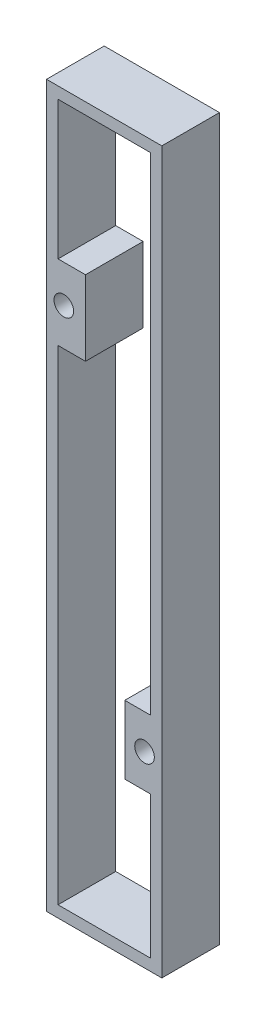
ISO-10303-21;
HEADER;
FILE_DESCRIPTION(('STEP AP214'),'2;1');
FILE_NAME('part.step','',(''),(''),'','','');
FILE_SCHEMA(('AUTOMOTIVE_DESIGN { 1 0 10303 214 1 1 1 1 }'));
ENDSEC;
DATA;
#1=APPLICATION_CONTEXT('core data for automotive mechanical design processes');
#2=APPLICATION_PROTOCOL_DEFINITION('international standard','automotive_design',2000,#1);
#3=PRODUCT_CONTEXT('',#1,'mechanical');
#4=PRODUCT('Part','Part','',(#3));
#5=PRODUCT_RELATED_PRODUCT_CATEGORY('part','',(#4));
#6=PRODUCT_DEFINITION_FORMATION('','',#4);
#7=PRODUCT_DEFINITION_CONTEXT('part definition',#1,'design');
#8=PRODUCT_DEFINITION('design','',#6,#7);
#9=PRODUCT_DEFINITION_SHAPE('','',#8);
#10=(LENGTH_UNIT() NAMED_UNIT(*) SI_UNIT(.MILLI.,.METRE.));
#11=(NAMED_UNIT(*) PLANE_ANGLE_UNIT() SI_UNIT($,.RADIAN.));
#12=(NAMED_UNIT(*) SI_UNIT($,.STERADIAN.) SOLID_ANGLE_UNIT());
#13=UNCERTAINTY_MEASURE_WITH_UNIT(LENGTH_MEASURE(1.E-05),#10,'distance_accuracy_value','');
#14=(GEOMETRIC_REPRESENTATION_CONTEXT(3) GLOBAL_UNCERTAINTY_ASSIGNED_CONTEXT((#13)) GLOBAL_UNIT_ASSIGNED_CONTEXT((#10,
#11,#12)) REPRESENTATION_CONTEXT('',''));
#15=CARTESIAN_POINT('',(0.,0.,0.));
#16=DIRECTION('',(0.,0.,1.));
#17=DIRECTION('',(1.,0.,0.));
#18=AXIS2_PLACEMENT_3D('',#15,#16,#17);
#19=CARTESIAN_POINT('',(22.86,2.54,0.));
#20=DIRECTION('',(1.,0.,0.));
#21=DIRECTION('',(0.,0.,-1.));
#22=AXIS2_PLACEMENT_3D('',#19,#20,#21);
#23=PLANE('',#22);
#24=DIRECTION('',(0.,0.,-1.));
#25=VECTOR('',#24,1.);
#26=CARTESIAN_POINT('',(22.86,2.54,0.));
#27=LINE('',#26,#25);
#28=CARTESIAN_POINT('',(22.86,2.54,0.));
#29=VERTEX_POINT('',#28);
#30=CARTESIAN_POINT('',(22.86,2.54,12.7));
#31=VERTEX_POINT('',#30);
#32=EDGE_CURVE('E127',#29,#31,#27,.F.);
#33=ORIENTED_EDGE('',*,*,#32,.T.);
#34=DIRECTION('',(0.,1.,0.));
#35=VECTOR('',#34,1.);
#36=CARTESIAN_POINT('',(22.86,79.375,12.7));
#37=LINE('',#36,#35);
#38=CARTESIAN_POINT('',(22.86,33.8558442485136,12.7));
#39=VERTEX_POINT('',#38);
#40=EDGE_CURVE('E265',#39,#31,#37,.F.);
#41=ORIENTED_EDGE('',*,*,#40,.F.);
#42=DIRECTION('',(0.,0.,1.));
#43=VECTOR('',#42,1.);
#44=CARTESIAN_POINT('',(22.86,33.8558442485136,0.));
#45=LINE('',#44,#43);
#46=CARTESIAN_POINT('',(22.86,33.8558442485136,0.));
#47=VERTEX_POINT('',#46);
#48=EDGE_CURVE('E161',#39,#47,#45,.F.);
#49=ORIENTED_EDGE('',*,*,#48,.T.);
#50=DIRECTION('',(0.,1.,0.));
#51=VECTOR('',#50,1.);
#52=CARTESIAN_POINT('',(22.86,79.375,0.));
#53=LINE('',#52,#51);
#54=EDGE_CURVE('E197',#47,#29,#53,.F.);
#55=ORIENTED_EDGE('',*,*,#54,.T.);
#56=EDGE_LOOP('',(#33,#41,#49,#55));
#57=FACE_BOUND('',#56,.T.);
#58=ADVANCED_FACE('F17',(#57),#23,.F.);
#59=CARTESIAN_POINT('',(2.54,2.54,0.));
#60=DIRECTION('',(0.,-1.,0.));
#61=DIRECTION('',(0.,0.,-1.));
#62=AXIS2_PLACEMENT_3D('',#59,#60,#61);
#63=PLANE('',#62);
#64=DIRECTION('',(0.,0.,1.));
#65=VECTOR('',#64,1.);
#66=CARTESIAN_POINT('',(2.54,2.54,0.));
#67=LINE('',#66,#65);
#68=CARTESIAN_POINT('',(2.54,2.54,0.));
#69=VERTEX_POINT('',#68);
#70=CARTESIAN_POINT('',(2.54,2.54,12.7));
#71=VERTEX_POINT('',#70);
#72=EDGE_CURVE('E133',#69,#71,#67,.T.);
#73=ORIENTED_EDGE('',*,*,#72,.T.);
#74=DIRECTION('',(1.,0.,0.));
#75=VECTOR('',#74,1.);
#76=CARTESIAN_POINT('',(12.7,2.54,12.7));
#77=LINE('',#76,#75);
#78=EDGE_CURVE('E263',#31,#71,#77,.F.);
#79=ORIENTED_EDGE('',*,*,#78,.F.);
#80=ORIENTED_EDGE('',*,*,#32,.F.);
#81=DIRECTION('',(1.,0.,0.));
#82=VECTOR('',#81,1.);
#83=CARTESIAN_POINT('',(12.7,2.54,0.));
#84=LINE('',#83,#82);
#85=EDGE_CURVE('E130',#29,#69,#84,.F.);
#86=ORIENTED_EDGE('',*,*,#85,.T.);
#87=EDGE_LOOP('',(#73,#79,#80,#86));
#88=FACE_BOUND('',#87,.T.);
#89=ADVANCED_FACE('F132',(#88),#63,.F.);
#90=CARTESIAN_POINT('',(2.54,109.23915652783,0.));
#91=DIRECTION('',(-1.,0.,0.));
#92=DIRECTION('',(0.,0.,1.));
#93=AXIS2_PLACEMENT_3D('',#90,#91,#92);
#94=PLANE('',#93);
#95=DIRECTION('',(0.,0.,1.));
#96=VECTOR('',#95,1.);
#97=CARTESIAN_POINT('',(2.54,109.23915652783,0.));
#98=LINE('',#97,#96);
#99=CARTESIAN_POINT('',(2.54,109.23915652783,0.));
#100=VERTEX_POINT('',#99);
#101=CARTESIAN_POINT('',(2.54,109.23915652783,12.7));
#102=VERTEX_POINT('',#101);
#103=EDGE_CURVE('E147',#100,#102,#98,.T.);
#104=ORIENTED_EDGE('',*,*,#103,.T.);
#105=DIRECTION('',(0.,1.,0.));
#106=VECTOR('',#105,1.);
#107=CARTESIAN_POINT('',(2.54,79.375,12.7));
#108=LINE('',#107,#106);
#109=EDGE_CURVE('E145',#71,#102,#108,.T.);
#110=ORIENTED_EDGE('',*,*,#109,.F.);
#111=ORIENTED_EDGE('',*,*,#72,.F.);
#112=DIRECTION('',(0.,1.,0.));
#113=VECTOR('',#112,1.);
#114=CARTESIAN_POINT('',(2.54,79.375,0.));
#115=LINE('',#114,#113);
#116=EDGE_CURVE('E138',#69,#100,#115,.T.);
#117=ORIENTED_EDGE('',*,*,#116,.T.);
#118=EDGE_LOOP('',(#104,#110,#111,#117));
#119=FACE_BOUND('',#118,.T.);
#120=ADVANCED_FACE('F142',(#119),#94,.F.);
#121=CARTESIAN_POINT('',(8.57944774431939,109.23915652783,0.));
#122=DIRECTION('',(0.,1.,0.));
#123=DIRECTION('',(0.,0.,1.));
#124=AXIS2_PLACEMENT_3D('',#121,#122,#123);
#125=PLANE('',#124);
#126=DIRECTION('',(0.,0.,1.));
#127=VECTOR('',#126,1.);
#128=CARTESIAN_POINT('',(8.57944774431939,109.23915652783,0.));
#129=LINE('',#128,#127);
#130=CARTESIAN_POINT('',(8.57944774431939,109.23915652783,0.));
#131=VERTEX_POINT('',#130);
#132=CARTESIAN_POINT('',(8.57944774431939,109.23915652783,12.7));
#133=VERTEX_POINT('',#132);
#134=EDGE_CURVE('E177',#131,#133,#129,.T.);
#135=ORIENTED_EDGE('',*,*,#134,.T.);
#136=DIRECTION('',(1.,0.,0.));
#137=VECTOR('',#136,1.);
#138=CARTESIAN_POINT('',(12.7,109.23915652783,12.7));
#139=LINE('',#138,#137);
#140=EDGE_CURVE('E259',#102,#133,#139,.T.);
#141=ORIENTED_EDGE('',*,*,#140,.F.);
#142=ORIENTED_EDGE('',*,*,#103,.F.);
#143=DIRECTION('',(1.,0.,0.));
#144=VECTOR('',#143,1.);
#145=CARTESIAN_POINT('',(12.7,109.23915652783,0.));
#146=LINE('',#145,#144);
#147=EDGE_CURVE('E154',#100,#131,#146,.T.);
#148=ORIENTED_EDGE('',*,*,#147,.T.);
#149=EDGE_LOOP('',(#135,#141,#142,#148));
#150=FACE_BOUND('',#149,.T.);
#151=ADVANCED_FACE('F322',(#150),#125,.F.);
#152=CARTESIAN_POINT('',(8.57944774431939,125.755380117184,0.));
#153=DIRECTION('',(-1.,0.,0.));
#154=DIRECTION('',(0.,0.,1.));
#155=AXIS2_PLACEMENT_3D('',#152,#153,#154);
#156=PLANE('',#155);
#157=DIRECTION('',(0.,0.,-1.));
#158=VECTOR('',#157,1.);
#159=CARTESIAN_POINT('',(8.57944774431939,125.755380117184,0.));
#160=LINE('',#159,#158);
#161=CARTESIAN_POINT('',(8.57944774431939,125.755380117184,0.));
#162=VERTEX_POINT('',#161);
#163=CARTESIAN_POINT('',(8.57944774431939,125.755380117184,12.7));
#164=VERTEX_POINT('',#163);
#165=EDGE_CURVE('E175',#162,#164,#160,.F.);
#166=ORIENTED_EDGE('',*,*,#165,.T.);
#167=DIRECTION('',(0.,1.,0.));
#168=VECTOR('',#167,1.);
#169=CARTESIAN_POINT('',(8.57944774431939,79.375,12.7));
#170=LINE('',#169,#168);
#171=EDGE_CURVE('E254',#133,#164,#170,.T.);
#172=ORIENTED_EDGE('',*,*,#171,.F.);
#173=ORIENTED_EDGE('',*,*,#134,.F.);
#174=DIRECTION('',(0.,1.,0.));
#175=VECTOR('',#174,1.);
#176=CARTESIAN_POINT('',(8.57944774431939,79.375,0.));
#177=LINE('',#176,#175);
#178=EDGE_CURVE('E156',#131,#162,#177,.T.);
#179=ORIENTED_EDGE('',*,*,#178,.T.);
#180=EDGE_LOOP('',(#166,#172,#173,#179));
#181=FACE_BOUND('',#180,.T.);
#182=ADVANCED_FACE('F221',(#181),#156,.F.);
#183=CARTESIAN_POINT('',(2.54,125.755380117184,0.));
#184=DIRECTION('',(0.,-1.,0.));
#185=DIRECTION('',(0.,0.,-1.));
#186=AXIS2_PLACEMENT_3D('',#183,#184,#185);
#187=PLANE('',#186);
#188=DIRECTION('',(0.,0.,1.));
#189=VECTOR('',#188,1.);
#190=CARTESIAN_POINT('',(2.54,125.755380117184,0.));
#191=LINE('',#190,#189);
#192=CARTESIAN_POINT('',(2.54,125.755380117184,0.));
#193=VERTEX_POINT('',#192);
#194=CARTESIAN_POINT('',(2.54,125.755380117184,12.7));
#195=VERTEX_POINT('',#194);
#196=EDGE_CURVE('E173',#193,#195,#191,.T.);
#197=ORIENTED_EDGE('',*,*,#196,.T.);
#198=DIRECTION('',(1.,0.,0.));
#199=VECTOR('',#198,1.);
#200=CARTESIAN_POINT('',(12.7,125.755380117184,12.7));
#201=LINE('',#200,#199);
#202=EDGE_CURVE('E229',#164,#195,#201,.F.);
#203=ORIENTED_EDGE('',*,*,#202,.F.);
#204=ORIENTED_EDGE('',*,*,#165,.F.);
#205=DIRECTION('',(1.,0.,0.));
#206=VECTOR('',#205,1.);
#207=CARTESIAN_POINT('',(12.7,125.755380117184,0.));
#208=LINE('',#207,#206);
#209=EDGE_CURVE('E217',#162,#193,#208,.F.);
#210=ORIENTED_EDGE('',*,*,#209,.T.);
#211=EDGE_LOOP('',(#197,#203,#204,#210));
#212=FACE_BOUND('',#211,.T.);
#213=ADVANCED_FACE('F226',(#212),#187,.F.);
#214=CARTESIAN_POINT('',(2.54,156.21,0.));
#215=DIRECTION('',(-1.,0.,0.));
#216=DIRECTION('',(0.,0.,1.));
#217=AXIS2_PLACEMENT_3D('',#214,#215,#216);
#218=PLANE('',#217);
#219=DIRECTION('',(0.,0.,1.));
#220=VECTOR('',#219,1.);
#221=CARTESIAN_POINT('',(2.54,156.21,0.));
#222=LINE('',#221,#220);
#223=CARTESIAN_POINT('',(2.54,156.21,0.));
#224=VERTEX_POINT('',#223);
#225=CARTESIAN_POINT('',(2.54,156.21,12.7));
#226=VERTEX_POINT('',#225);
#227=EDGE_CURVE('E171',#224,#226,#222,.T.);
#228=ORIENTED_EDGE('',*,*,#227,.T.);
#229=DIRECTION('',(0.,1.,0.));
#230=VECTOR('',#229,1.);
#231=CARTESIAN_POINT('',(2.54,79.375,12.7));
#232=LINE('',#231,#230);
#233=EDGE_CURVE('E249',#195,#226,#232,.T.);
#234=ORIENTED_EDGE('',*,*,#233,.F.);
#235=ORIENTED_EDGE('',*,*,#196,.F.);
#236=DIRECTION('',(0.,1.,0.));
#237=VECTOR('',#236,1.);
#238=CARTESIAN_POINT('',(2.54,79.375,0.));
#239=LINE('',#238,#237);
#240=EDGE_CURVE('E215',#193,#224,#239,.T.);
#241=ORIENTED_EDGE('',*,*,#240,.T.);
#242=EDGE_LOOP('',(#228,#234,#235,#241));
#243=FACE_BOUND('',#242,.T.);
#244=ADVANCED_FACE('F236',(#243),#218,.F.);
#245=CARTESIAN_POINT('',(22.86,156.21,0.));
#246=DIRECTION('',(0.,1.,0.));
#247=DIRECTION('',(0.,0.,1.));
#248=AXIS2_PLACEMENT_3D('',#245,#246,#247);
#249=PLANE('',#248);
#250=DIRECTION('',(0.,0.,-1.));
#251=VECTOR('',#250,1.);
#252=CARTESIAN_POINT('',(22.86,156.21,0.));
#253=LINE('',#252,#251);
#254=CARTESIAN_POINT('',(22.86,156.21,0.));
#255=VERTEX_POINT('',#254);
#256=CARTESIAN_POINT('',(22.86,156.21,12.7));
#257=VERTEX_POINT('',#256);
#258=EDGE_CURVE('E169',#255,#257,#253,.F.);
#259=ORIENTED_EDGE('',*,*,#258,.T.);
#260=DIRECTION('',(1.,0.,0.));
#261=VECTOR('',#260,1.);
#262=CARTESIAN_POINT('',(12.7,156.21,12.7));
#263=LINE('',#262,#261);
#264=EDGE_CURVE('E243',#226,#257,#263,.T.);
#265=ORIENTED_EDGE('',*,*,#264,.F.);
#266=ORIENTED_EDGE('',*,*,#227,.F.);
#267=DIRECTION('',(1.,0.,0.));
#268=VECTOR('',#267,1.);
#269=CARTESIAN_POINT('',(12.7,156.21,0.));
#270=LINE('',#269,#268);
#271=EDGE_CURVE('E213',#224,#255,#270,.T.);
#272=ORIENTED_EDGE('',*,*,#271,.T.);
#273=EDGE_LOOP('',(#259,#265,#266,#272));
#274=FACE_BOUND('',#273,.T.);
#275=ADVANCED_FACE('F240',(#274),#249,.F.);
#276=CARTESIAN_POINT('',(22.86,48.8946351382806,0.));
#277=DIRECTION('',(1.,0.,0.));
#278=DIRECTION('',(0.,0.,-1.));
#279=AXIS2_PLACEMENT_3D('',#276,#277,#278);
#280=PLANE('',#279);
#281=DIRECTION('',(0.,0.,-1.));
#282=VECTOR('',#281,1.);
#283=CARTESIAN_POINT('',(22.86,48.8946351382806,0.));
#284=LINE('',#283,#282);
#285=CARTESIAN_POINT('',(22.86,48.8946351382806,0.));
#286=VERTEX_POINT('',#285);
#287=CARTESIAN_POINT('',(22.86,48.8946351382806,12.7));
#288=VERTEX_POINT('',#287);
#289=EDGE_CURVE('E167',#286,#288,#284,.F.);
#290=ORIENTED_EDGE('',*,*,#289,.T.);
#291=DIRECTION('',(0.,1.,0.));
#292=VECTOR('',#291,1.);
#293=CARTESIAN_POINT('',(22.86,79.375,12.7));
#294=LINE('',#293,#292);
#295=EDGE_CURVE('E248',#257,#288,#294,.F.);
#296=ORIENTED_EDGE('',*,*,#295,.F.);
#297=ORIENTED_EDGE('',*,*,#258,.F.);
#298=DIRECTION('',(0.,1.,0.));
#299=VECTOR('',#298,1.);
#300=CARTESIAN_POINT('',(22.86,79.375,0.));
#301=LINE('',#300,#299);
#302=EDGE_CURVE('E211',#255,#286,#301,.F.);
#303=ORIENTED_EDGE('',*,*,#302,.T.);
#304=EDGE_LOOP('',(#290,#296,#297,#303));
#305=FACE_BOUND('',#304,.T.);
#306=ADVANCED_FACE('F305',(#305),#280,.F.);
#307=CARTESIAN_POINT('',(17.2372983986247,48.8946351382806,0.));
#308=DIRECTION('',(0.,-1.,0.));
#309=DIRECTION('',(0.,0.,-1.));
#310=AXIS2_PLACEMENT_3D('',#307,#308,#309);
#311=PLANE('',#310);
#312=DIRECTION('',(0.,0.,-1.));
#313=VECTOR('',#312,1.);
#314=CARTESIAN_POINT('',(17.2372983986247,48.8946351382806,0.));
#315=LINE('',#314,#313);
#316=CARTESIAN_POINT('',(17.2372983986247,48.8946351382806,0.));
#317=VERTEX_POINT('',#316);
#318=CARTESIAN_POINT('',(17.2372983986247,48.8946351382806,12.7));
#319=VERTEX_POINT('',#318);
#320=EDGE_CURVE('E165',#317,#319,#315,.F.);
#321=ORIENTED_EDGE('',*,*,#320,.T.);
#322=DIRECTION('',(1.,0.,0.));
#323=VECTOR('',#322,1.);
#324=CARTESIAN_POINT('',(12.7,48.8946351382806,12.7));
#325=LINE('',#324,#323);
#326=EDGE_CURVE('E301',#288,#319,#325,.F.);
#327=ORIENTED_EDGE('',*,*,#326,.F.);
#328=ORIENTED_EDGE('',*,*,#289,.F.);
#329=DIRECTION('',(1.,0.,0.));
#330=VECTOR('',#329,1.);
#331=CARTESIAN_POINT('',(12.7,48.8946351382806,0.));
#332=LINE('',#331,#330);
#333=EDGE_CURVE('E209',#286,#317,#332,.F.);
#334=ORIENTED_EDGE('',*,*,#333,.T.);
#335=EDGE_LOOP('',(#321,#327,#328,#334));
#336=FACE_BOUND('',#335,.T.);
#337=ADVANCED_FACE('F309',(#336),#311,.F.);
#338=CARTESIAN_POINT('',(17.2372983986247,33.8558442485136,0.));
#339=DIRECTION('',(1.,0.,0.));
#340=DIRECTION('',(0.,0.,-1.));
#341=AXIS2_PLACEMENT_3D('',#338,#339,#340);
#342=PLANE('',#341);
#343=DIRECTION('',(0.,0.,1.));
#344=VECTOR('',#343,1.);
#345=CARTESIAN_POINT('',(17.2372983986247,33.8558442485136,0.));
#346=LINE('',#345,#344);
#347=CARTESIAN_POINT('',(17.2372983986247,33.8558442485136,0.));
#348=VERTEX_POINT('',#347);
#349=CARTESIAN_POINT('',(17.2372983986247,33.8558442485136,12.7));
#350=VERTEX_POINT('',#349);
#351=EDGE_CURVE('E163',#348,#350,#346,.T.);
#352=ORIENTED_EDGE('',*,*,#351,.T.);
#353=DIRECTION('',(0.,1.,0.));
#354=VECTOR('',#353,1.);
#355=CARTESIAN_POINT('',(17.2372983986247,79.375,12.7));
#356=LINE('',#355,#354);
#357=EDGE_CURVE('E299',#319,#350,#356,.F.);
#358=ORIENTED_EDGE('',*,*,#357,.F.);
#359=ORIENTED_EDGE('',*,*,#320,.F.);
#360=DIRECTION('',(0.,1.,0.));
#361=VECTOR('',#360,1.);
#362=CARTESIAN_POINT('',(17.2372983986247,79.375,0.));
#363=LINE('',#362,#361);
#364=EDGE_CURVE('E204',#317,#348,#363,.F.);
#365=ORIENTED_EDGE('',*,*,#364,.T.);
#366=EDGE_LOOP('',(#352,#358,#359,#365));
#367=FACE_BOUND('',#366,.T.);
#368=ADVANCED_FACE('F314',(#367),#342,.F.);
#369=CARTESIAN_POINT('',(22.86,33.8558442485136,0.));
#370=DIRECTION('',(0.,1.,0.));
#371=DIRECTION('',(0.,0.,1.));
#372=AXIS2_PLACEMENT_3D('',#369,#370,#371);
#373=PLANE('',#372);
#374=ORIENTED_EDGE('',*,*,#48,.F.);
#375=DIRECTION('',(1.,0.,0.));
#376=VECTOR('',#375,1.);
#377=CARTESIAN_POINT('',(12.7,33.8558442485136,12.7));
#378=LINE('',#377,#376);
#379=EDGE_CURVE('E187',#350,#39,#378,.T.);
#380=ORIENTED_EDGE('',*,*,#379,.F.);
#381=ORIENTED_EDGE('',*,*,#351,.F.);
#382=DIRECTION('',(1.,0.,0.));
#383=VECTOR('',#382,1.);
#384=CARTESIAN_POINT('',(12.7,33.8558442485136,0.));
#385=LINE('',#384,#383);
#386=EDGE_CURVE('E200',#348,#47,#385,.T.);
#387=ORIENTED_EDGE('',*,*,#386,.T.);
#388=EDGE_LOOP('',(#374,#380,#381,#387));
#389=FACE_BOUND('',#388,.T.);
#390=ADVANCED_FACE('F319',(#389),#373,.F.);
#391=CARTESIAN_POINT('',(21.59,41.275,0.));
#392=DIRECTION('',(0.,0.,1.));
#393=DIRECTION('',(1.,0.,0.));
#394=AXIS2_PLACEMENT_3D('',#391,#392,#393);
#395=CYLINDRICAL_SURFACE('',#394,2.159);
#396=CARTESIAN_POINT('',(21.59,41.275,0.));
#397=DIRECTION('',(0.,0.,1.));
#398=DIRECTION('',(1.,0.,0.));
#399=AXIS2_PLACEMENT_3D('',#396,#397,#398);
#400=CIRCLE('',#399,2.159);
#401=CARTESIAN_POINT('',(23.749,41.275,0.));
#402=VERTEX_POINT('',#401);
#403=EDGE_CURVE('E20',#402,#402,#400,.F.);
#404=ORIENTED_EDGE('',*,*,#403,.T.);
#405=EDGE_LOOP('',(#404));
#406=FACE_BOUND('',#405,.T.);
#407=CARTESIAN_POINT('',(21.59,41.275,12.7));
#408=DIRECTION('',(0.,0.,1.));
#409=DIRECTION('',(1.,0.,0.));
#410=AXIS2_PLACEMENT_3D('',#407,#408,#409);
#411=CIRCLE('',#410,2.159);
#412=CARTESIAN_POINT('',(23.749,41.275,12.7));
#413=VERTEX_POINT('',#412);
#414=EDGE_CURVE('E185',#413,#413,#411,.F.);
#415=ORIENTED_EDGE('',*,*,#414,.F.);
#416=EDGE_LOOP('',(#415));
#417=FACE_BOUND('',#416,.T.);
#418=ADVANCED_FACE('F354',(#406,#417),#395,.F.);
#419=CARTESIAN_POINT('',(3.81,117.475,0.));
#420=DIRECTION('',(0.,0.,1.));
#421=DIRECTION('',(1.,0.,0.));
#422=AXIS2_PLACEMENT_3D('',#419,#420,#421);
#423=CYLINDRICAL_SURFACE('',#422,2.159);
#424=CARTESIAN_POINT('',(3.81,117.475,0.));
#425=DIRECTION('',(0.,0.,1.));
#426=DIRECTION('',(1.,0.,0.));
#427=AXIS2_PLACEMENT_3D('',#424,#425,#426);
#428=CIRCLE('',#427,2.159);
#429=CARTESIAN_POINT('',(5.969,117.475,0.));
#430=VERTEX_POINT('',#429);
#431=EDGE_CURVE('E188',#430,#430,#428,.F.);
#432=ORIENTED_EDGE('',*,*,#431,.T.);
#433=EDGE_LOOP('',(#432));
#434=FACE_BOUND('',#433,.T.);
#435=CARTESIAN_POINT('',(3.81,117.475,12.7));
#436=DIRECTION('',(0.,0.,1.));
#437=DIRECTION('',(1.,0.,0.));
#438=AXIS2_PLACEMENT_3D('',#435,#436,#437);
#439=CIRCLE('',#438,2.159);
#440=CARTESIAN_POINT('',(5.969,117.475,12.7));
#441=VERTEX_POINT('',#440);
#442=EDGE_CURVE('E181',#441,#441,#439,.F.);
#443=ORIENTED_EDGE('',*,*,#442,.F.);
#444=EDGE_LOOP('',(#443));
#445=FACE_BOUND('',#444,.T.);
#446=ADVANCED_FACE('F351',(#434,#445),#423,.F.);
#447=CARTESIAN_POINT('',(25.4,0.,0.));
#448=DIRECTION('',(1.,0.,0.));
#449=DIRECTION('',(0.,0.,-1.));
#450=AXIS2_PLACEMENT_3D('',#447,#448,#449);
#451=PLANE('',#450);
#452=DIRECTION('',(0.,1.,0.));
#453=VECTOR('',#452,1.);
#454=CARTESIAN_POINT('',(25.4,79.375,12.7));
#455=LINE('',#454,#453);
#456=CARTESIAN_POINT('',(25.4,0.,12.7));
#457=VERTEX_POINT('',#456);
#458=CARTESIAN_POINT('',(25.4,158.75,12.7));
#459=VERTEX_POINT('',#458);
#460=EDGE_CURVE('E268',#457,#459,#455,.T.);
#461=ORIENTED_EDGE('',*,*,#460,.F.);
#462=DIRECTION('',(0.,0.,-1.));
#463=VECTOR('',#462,1.);
#464=CARTESIAN_POINT('',(25.4,0.,0.));
#465=LINE('',#464,#463);
#466=CARTESIAN_POINT('',(25.4,0.,0.));
#467=VERTEX_POINT('',#466);
#468=EDGE_CURVE('E194',#467,#457,#465,.F.);
#469=ORIENTED_EDGE('',*,*,#468,.F.);
#470=DIRECTION('',(0.,1.,0.));
#471=VECTOR('',#470,1.);
#472=CARTESIAN_POINT('',(25.4,79.375,0.));
#473=LINE('',#472,#471);
#474=CARTESIAN_POINT('',(25.4,158.75,0.));
#475=VERTEX_POINT('',#474);
#476=EDGE_CURVE('E139',#467,#475,#473,.T.);
#477=ORIENTED_EDGE('',*,*,#476,.T.);
#478=DIRECTION('',(0.,0.,1.));
#479=VECTOR('',#478,1.);
#480=CARTESIAN_POINT('',(25.4,158.75,0.));
#481=LINE('',#480,#479);
#482=EDGE_CURVE('E281',#459,#475,#481,.F.);
#483=ORIENTED_EDGE('',*,*,#482,.F.);
#484=EDGE_LOOP('',(#461,#469,#477,#483));
#485=FACE_BOUND('',#484,.T.);
#486=ADVANCED_FACE('F279',(#485),#451,.T.);
#487=CARTESIAN_POINT('',(12.7,79.375,0.));
#488=DIRECTION('',(0.,0.,1.));
#489=DIRECTION('',(1.,0.,0.));
#490=AXIS2_PLACEMENT_3D('',#487,#488,#489);
#491=PLANE('',#490);
#492=ORIENTED_EDGE('',*,*,#431,.F.);
#493=EDGE_LOOP('',(#492));
#494=FACE_BOUND('',#493,.T.);
#495=ORIENTED_EDGE('',*,*,#403,.F.);
#496=EDGE_LOOP('',(#495));
#497=FACE_BOUND('',#496,.T.);
#498=ORIENTED_EDGE('',*,*,#386,.F.);
#499=ORIENTED_EDGE('',*,*,#364,.F.);
#500=ORIENTED_EDGE('',*,*,#333,.F.);
#501=ORIENTED_EDGE('',*,*,#302,.F.);
#502=ORIENTED_EDGE('',*,*,#271,.F.);
#503=ORIENTED_EDGE('',*,*,#240,.F.);
#504=ORIENTED_EDGE('',*,*,#209,.F.);
#505=ORIENTED_EDGE('',*,*,#178,.F.);
#506=ORIENTED_EDGE('',*,*,#147,.F.);
#507=ORIENTED_EDGE('',*,*,#116,.F.);
#508=ORIENTED_EDGE('',*,*,#85,.F.);
#509=ORIENTED_EDGE('',*,*,#54,.F.);
#510=EDGE_LOOP('',(#498,#499,#500,#501,#502,#503,#504,#505,#506,#507,#508,#509));
#511=FACE_BOUND('',#510,.T.);
#512=DIRECTION('',(0.,1.,0.));
#513=VECTOR('',#512,1.);
#514=CARTESIAN_POINT('',(0.,158.75,0.));
#515=LINE('',#514,#513);
#516=CARTESIAN_POINT('',(0.,158.75,0.));
#517=VERTEX_POINT('',#516);
#518=CARTESIAN_POINT('',(0.,0.,0.));
#519=VERTEX_POINT('',#518);
#520=EDGE_CURVE('E289',#517,#519,#515,.F.);
#521=ORIENTED_EDGE('',*,*,#520,.F.);
#522=DIRECTION('',(1.,0.,0.));
#523=VECTOR('',#522,1.);
#524=CARTESIAN_POINT('',(25.4,158.75,0.));
#525=LINE('',#524,#523);
#526=EDGE_CURVE('E184',#475,#517,#525,.F.);
#527=ORIENTED_EDGE('',*,*,#526,.F.);
#528=ORIENTED_EDGE('',*,*,#476,.F.);
#529=DIRECTION('',(1.,0.,0.));
#530=VECTOR('',#529,1.);
#531=CARTESIAN_POINT('',(0.,0.,0.));
#532=LINE('',#531,#530);
#533=EDGE_CURVE('E190',#519,#467,#532,.T.);
#534=ORIENTED_EDGE('',*,*,#533,.F.);
#535=EDGE_LOOP('',(#521,#527,#528,#534));
#536=FACE_BOUND('',#535,.T.);
#537=ADVANCED_FACE('F151',(#494,#497,#511,#536),#491,.F.);
#538=CARTESIAN_POINT('',(0.,0.,0.));
#539=DIRECTION('',(0.,-1.,0.));
#540=DIRECTION('',(0.,0.,-1.));
#541=AXIS2_PLACEMENT_3D('',#538,#539,#540);
#542=PLANE('',#541);
#543=DIRECTION('',(1.,0.,0.));
#544=VECTOR('',#543,1.);
#545=CARTESIAN_POINT('',(12.7,0.,12.7));
#546=LINE('',#545,#544);
#547=CARTESIAN_POINT('',(0.,0.,12.7));
#548=VERTEX_POINT('',#547);
#549=EDGE_CURVE('E270',#548,#457,#546,.T.);
#550=ORIENTED_EDGE('',*,*,#549,.F.);
#551=DIRECTION('',(0.,0.,1.));
#552=VECTOR('',#551,1.);
#553=CARTESIAN_POINT('',(0.,0.,0.));
#554=LINE('',#553,#552);
#555=EDGE_CURVE('E285',#519,#548,#554,.T.);
#556=ORIENTED_EDGE('',*,*,#555,.F.);
#557=ORIENTED_EDGE('',*,*,#533,.T.);
#558=ORIENTED_EDGE('',*,*,#468,.T.);
#559=EDGE_LOOP('',(#550,#556,#557,#558));
#560=FACE_BOUND('',#559,.T.);
#561=ADVANCED_FACE('F275',(#560),#542,.T.);
#562=CARTESIAN_POINT('',(12.7,79.375,12.7));
#563=DIRECTION('',(0.,0.,1.));
#564=DIRECTION('',(1.,0.,0.));
#565=AXIS2_PLACEMENT_3D('',#562,#563,#564);
#566=PLANE('',#565);
#567=ORIENTED_EDGE('',*,*,#442,.T.);
#568=EDGE_LOOP('',(#567));
#569=FACE_BOUND('',#568,.T.);
#570=ORIENTED_EDGE('',*,*,#414,.T.);
#571=EDGE_LOOP('',(#570));
#572=FACE_BOUND('',#571,.T.);
#573=ORIENTED_EDGE('',*,*,#357,.T.);
#574=ORIENTED_EDGE('',*,*,#379,.T.);
#575=ORIENTED_EDGE('',*,*,#40,.T.);
#576=ORIENTED_EDGE('',*,*,#78,.T.);
#577=ORIENTED_EDGE('',*,*,#109,.T.);
#578=ORIENTED_EDGE('',*,*,#140,.T.);
#579=ORIENTED_EDGE('',*,*,#171,.T.);
#580=ORIENTED_EDGE('',*,*,#202,.T.);
#581=ORIENTED_EDGE('',*,*,#233,.T.);
#582=ORIENTED_EDGE('',*,*,#264,.T.);
#583=ORIENTED_EDGE('',*,*,#295,.T.);
#584=ORIENTED_EDGE('',*,*,#326,.T.);
#585=EDGE_LOOP('',(#573,#574,#575,#576,#577,#578,#579,#580,#581,#582,#583,#584));
#586=FACE_BOUND('',#585,.T.);
#587=DIRECTION('',(1.,0.,0.));
#588=VECTOR('',#587,1.);
#589=CARTESIAN_POINT('',(25.4,158.75,12.7));
#590=LINE('',#589,#588);
#591=CARTESIAN_POINT('',(0.,158.75,12.7));
#592=VERTEX_POINT('',#591);
#593=EDGE_CURVE('E35',#592,#459,#590,.T.);
#594=ORIENTED_EDGE('',*,*,#593,.F.);
#595=DIRECTION('',(0.,1.,0.));
#596=VECTOR('',#595,1.);
#597=CARTESIAN_POINT('',(0.,158.75,12.7));
#598=LINE('',#597,#596);
#599=EDGE_CURVE('E26',#548,#592,#598,.T.);
#600=ORIENTED_EDGE('',*,*,#599,.F.);
#601=ORIENTED_EDGE('',*,*,#549,.T.);
#602=ORIENTED_EDGE('',*,*,#460,.T.);
#603=EDGE_LOOP('',(#594,#600,#601,#602));
#604=FACE_BOUND('',#603,.T.);
#605=ADVANCED_FACE('F252',(#569,#572,#586,#604),#566,.T.);
#606=CARTESIAN_POINT('',(25.4,158.75,0.));
#607=DIRECTION('',(0.,1.,0.));
#608=DIRECTION('',(0.,0.,1.));
#609=AXIS2_PLACEMENT_3D('',#606,#607,#608);
#610=PLANE('',#609);
#611=ORIENTED_EDGE('',*,*,#593,.T.);
#612=ORIENTED_EDGE('',*,*,#482,.T.);
#613=ORIENTED_EDGE('',*,*,#526,.T.);
#614=DIRECTION('',(0.,0.,1.));
#615=VECTOR('',#614,1.);
#616=CARTESIAN_POINT('',(0.,158.75,0.));
#617=LINE('',#616,#615);
#618=EDGE_CURVE('E11',#592,#517,#617,.F.);
#619=ORIENTED_EDGE('',*,*,#618,.F.);
#620=EDGE_LOOP('',(#611,#612,#613,#619));
#621=FACE_BOUND('',#620,.T.);
#622=ADVANCED_FACE('F333',(#621),#610,.T.);
#623=CARTESIAN_POINT('',(0.,158.75,0.));
#624=DIRECTION('',(-1.,0.,0.));
#625=DIRECTION('',(0.,0.,1.));
#626=AXIS2_PLACEMENT_3D('',#623,#624,#625);
#627=PLANE('',#626);
#628=ORIENTED_EDGE('',*,*,#599,.T.);
#629=ORIENTED_EDGE('',*,*,#618,.T.);
#630=ORIENTED_EDGE('',*,*,#520,.T.);
#631=ORIENTED_EDGE('',*,*,#555,.T.);
#632=EDGE_LOOP('',(#628,#629,#630,#631));
#633=FACE_BOUND('',#632,.T.);
#634=ADVANCED_FACE('F288',(#633),#627,.T.);
#635=CLOSED_SHELL('',(#58,#89,#120,#151,#182,#213,#244,#275,#306,#337,#368,#390,#418,#446,#486,
#537,#561,#605,#622,#634));
#636=MANIFOLD_SOLID_BREP('B1',#635);
#637=ADVANCED_BREP_SHAPE_REPRESENTATION('',(#18,#636),#14);
#638=SHAPE_DEFINITION_REPRESENTATION(#9,#637);
ENDSEC;
END-ISO-10303-21;
